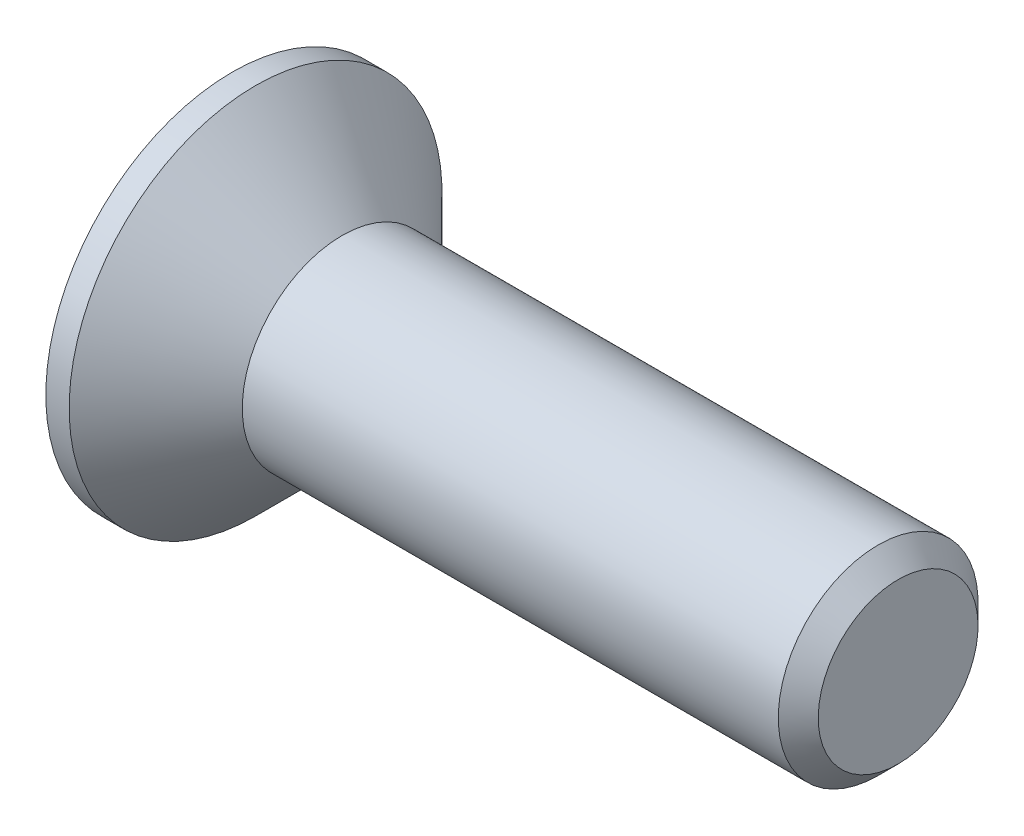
ISO-10303-21;
HEADER;
FILE_DESCRIPTION(('STEP AP214'),'2;1');
FILE_NAME('part.step','',(''),(''),'','','');
FILE_SCHEMA(('AUTOMOTIVE_DESIGN { 1 0 10303 214 1 1 1 1 }'));
ENDSEC;
DATA;
#1=APPLICATION_CONTEXT('core data for automotive mechanical design processes');
#2=APPLICATION_PROTOCOL_DEFINITION('international standard','automotive_design',2000,#1);
#3=PRODUCT_CONTEXT('',#1,'mechanical');
#4=PRODUCT('Part','Part','',(#3));
#5=PRODUCT_RELATED_PRODUCT_CATEGORY('part','',(#4));
#6=PRODUCT_DEFINITION_FORMATION('','',#4);
#7=PRODUCT_DEFINITION_CONTEXT('part definition',#1,'design');
#8=PRODUCT_DEFINITION('design','',#6,#7);
#9=PRODUCT_DEFINITION_SHAPE('','',#8);
#10=(LENGTH_UNIT() NAMED_UNIT(*) SI_UNIT(.MILLI.,.METRE.));
#11=(NAMED_UNIT(*) PLANE_ANGLE_UNIT() SI_UNIT($,.RADIAN.));
#12=(NAMED_UNIT(*) SI_UNIT($,.STERADIAN.) SOLID_ANGLE_UNIT());
#13=UNCERTAINTY_MEASURE_WITH_UNIT(LENGTH_MEASURE(1.E-05),#10,'distance_accuracy_value','');
#14=(GEOMETRIC_REPRESENTATION_CONTEXT(3) GLOBAL_UNCERTAINTY_ASSIGNED_CONTEXT((#13)) GLOBAL_UNIT_ASSIGNED_CONTEXT((#10,
#11,#12)) REPRESENTATION_CONTEXT('',''));
#15=CARTESIAN_POINT('',(0.,0.,0.));
#16=DIRECTION('',(0.,0.,1.));
#17=DIRECTION('',(1.,0.,0.));
#18=AXIS2_PLACEMENT_3D('',#15,#16,#17);
#19=CARTESIAN_POINT('',(0.,0.,0.));
#20=DIRECTION('',(-1.,0.,0.));
#21=DIRECTION('',(0.,-1.,0.));
#22=AXIS2_PLACEMENT_3D('',#19,#20,#21);
#23=CONICAL_SURFACE('',#22,1.5,0.78539816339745);
#24=CARTESIAN_POINT('',(-1.3,0.,0.));
#25=DIRECTION('',(-1.,0.,0.));
#26=DIRECTION('',(0.,-1.,0.));
#27=AXIS2_PLACEMENT_3D('',#24,#25,#26);
#28=CIRCLE('',#27,2.8);
#29=CARTESIAN_POINT('',(-1.3,-2.8,0.));
#30=VERTEX_POINT('',#29);
#31=EDGE_CURVE('E189',#30,#30,#28,.T.);
#32=ORIENTED_EDGE('',*,*,#31,.F.);
#33=EDGE_LOOP('',(#32));
#34=FACE_BOUND('',#33,.T.);
#35=CARTESIAN_POINT('',(0.,0.,0.));
#36=DIRECTION('',(-1.,0.,0.));
#37=DIRECTION('',(0.,-1.,0.));
#38=AXIS2_PLACEMENT_3D('',#35,#36,#37);
#39=CIRCLE('',#38,1.5);
#40=CARTESIAN_POINT('',(0.,-1.5,0.));
#41=VERTEX_POINT('',#40);
#42=EDGE_CURVE('E212',#41,#41,#39,.T.);
#43=ORIENTED_EDGE('',*,*,#42,.T.);
#44=EDGE_LOOP('',(#43));
#45=FACE_BOUND('',#44,.T.);
#46=ADVANCED_FACE('F33',(#34,#45),#23,.T.);
#47=CARTESIAN_POINT('',(-1.65,0.,0.));
#48=DIRECTION('',(-1.,0.,0.));
#49=DIRECTION('',(0.,-1.,0.));
#50=AXIS2_PLACEMENT_3D('',#47,#48,#49);
#51=CYLINDRICAL_SURFACE('',#50,1.5);
#52=CARTESIAN_POINT('',(8.05,0.,0.));
#53=DIRECTION('',(-1.,0.,0.));
#54=DIRECTION('',(0.,-1.,0.));
#55=AXIS2_PLACEMENT_3D('',#52,#53,#54);
#56=CIRCLE('',#55,1.5);
#57=CARTESIAN_POINT('',(8.05,-1.5,0.));
#58=VERTEX_POINT('',#57);
#59=EDGE_CURVE('E41',#58,#58,#56,.T.);
#60=ORIENTED_EDGE('',*,*,#59,.T.);
#61=EDGE_LOOP('',(#60));
#62=FACE_BOUND('',#61,.T.);
#63=ORIENTED_EDGE('',*,*,#42,.F.);
#64=EDGE_LOOP('',(#63));
#65=FACE_BOUND('',#64,.T.);
#66=ADVANCED_FACE('F217',(#62,#65),#51,.T.);
#67=CARTESIAN_POINT('',(8.35,0.,0.));
#68=DIRECTION('',(-1.,0.,0.));
#69=DIRECTION('',(0.,-1.,0.));
#70=AXIS2_PLACEMENT_3D('',#67,#68,#69);
#71=PLANE('',#70);
#72=CARTESIAN_POINT('',(8.35,0.,0.));
#73=DIRECTION('',(-1.,0.,0.));
#74=DIRECTION('',(0.,-1.,0.));
#75=AXIS2_PLACEMENT_3D('',#72,#73,#74);
#76=CIRCLE('',#75,1.19999999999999);
#77=CARTESIAN_POINT('',(8.35,-1.19999999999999,0.));
#78=VERTEX_POINT('',#77);
#79=EDGE_CURVE('E11',#78,#78,#76,.F.);
#80=ORIENTED_EDGE('',*,*,#79,.T.);
#81=EDGE_LOOP('',(#80));
#82=FACE_BOUND('',#81,.T.);
#83=ADVANCED_FACE('F239',(#82),#71,.F.);
#84=CARTESIAN_POINT('',(-1.65,2.8,0.));
#85=DIRECTION('',(1.,0.,0.));
#86=DIRECTION('',(0.,1.,0.));
#87=AXIS2_PLACEMENT_3D('',#84,#85,#86);
#88=PLANE('',#87);
#89=DIRECTION('',(0.,0.,-1.));
#90=VECTOR('',#89,1.);
#91=CARTESIAN_POINT('',(-1.65,0.365,-1.45));
#92=LINE('',#91,#90);
#93=CARTESIAN_POINT('',(-1.65,0.365,-0.365));
#94=VERTEX_POINT('',#93);
#95=CARTESIAN_POINT('',(-1.65,0.365,-1.45));
#96=VERTEX_POINT('',#95);
#97=EDGE_CURVE('E158',#94,#96,#92,.T.);
#98=ORIENTED_EDGE('',*,*,#97,.F.);
#99=DIRECTION('',(0.,-1.,0.));
#100=VECTOR('',#99,1.);
#101=CARTESIAN_POINT('',(-1.65,0.365,-0.365));
#102=LINE('',#101,#100);
#103=CARTESIAN_POINT('',(-1.65,1.45,-0.365));
#104=VERTEX_POINT('',#103);
#105=EDGE_CURVE('E48',#104,#94,#102,.T.);
#106=ORIENTED_EDGE('',*,*,#105,.F.);
#107=DIRECTION('',(0.,0.,-1.));
#108=VECTOR('',#107,1.);
#109=CARTESIAN_POINT('',(-1.65,1.45,-0.365));
#110=LINE('',#109,#108);
#111=CARTESIAN_POINT('',(-1.65,1.45,0.365));
#112=VERTEX_POINT('',#111);
#113=EDGE_CURVE('E185',#112,#104,#110,.T.);
#114=ORIENTED_EDGE('',*,*,#113,.F.);
#115=DIRECTION('',(0.,1.,0.));
#116=VECTOR('',#115,1.);
#117=CARTESIAN_POINT('',(-1.65,1.45,0.365));
#118=LINE('',#117,#116);
#119=CARTESIAN_POINT('',(-1.65,0.365,0.365));
#120=VERTEX_POINT('',#119);
#121=EDGE_CURVE('E183',#120,#112,#118,.T.);
#122=ORIENTED_EDGE('',*,*,#121,.F.);
#123=DIRECTION('',(0.,0.,-1.));
#124=VECTOR('',#123,1.);
#125=CARTESIAN_POINT('',(-1.65,0.365,0.365));
#126=LINE('',#125,#124);
#127=CARTESIAN_POINT('',(-1.65,0.365,1.45));
#128=VERTEX_POINT('',#127);
#129=EDGE_CURVE('E132',#128,#120,#126,.T.);
#130=ORIENTED_EDGE('',*,*,#129,.F.);
#131=DIRECTION('',(0.,1.,0.));
#132=VECTOR('',#131,1.);
#133=CARTESIAN_POINT('',(-1.65,0.365,1.45));
#134=LINE('',#133,#132);
#135=CARTESIAN_POINT('',(-1.65,-0.365,1.45));
#136=VERTEX_POINT('',#135);
#137=EDGE_CURVE('E179',#136,#128,#134,.T.);
#138=ORIENTED_EDGE('',*,*,#137,.F.);
#139=DIRECTION('',(0.,0.,1.));
#140=VECTOR('',#139,1.);
#141=CARTESIAN_POINT('',(-1.65,-0.365,1.45));
#142=LINE('',#141,#140);
#143=CARTESIAN_POINT('',(-1.65,-0.365,0.365));
#144=VERTEX_POINT('',#143);
#145=EDGE_CURVE('E176',#144,#136,#142,.T.);
#146=ORIENTED_EDGE('',*,*,#145,.F.);
#147=DIRECTION('',(0.,1.,0.));
#148=VECTOR('',#147,1.);
#149=CARTESIAN_POINT('',(-1.65,-0.365,0.365));
#150=LINE('',#149,#148);
#151=CARTESIAN_POINT('',(-1.65,-1.45,0.365));
#152=VERTEX_POINT('',#151);
#153=EDGE_CURVE('E173',#152,#144,#150,.T.);
#154=ORIENTED_EDGE('',*,*,#153,.F.);
#155=DIRECTION('',(0.,0.,1.));
#156=VECTOR('',#155,1.);
#157=CARTESIAN_POINT('',(-1.65,-1.45,0.365));
#158=LINE('',#157,#156);
#159=CARTESIAN_POINT('',(-1.65,-1.45,-0.365));
#160=VERTEX_POINT('',#159);
#161=EDGE_CURVE('E170',#160,#152,#158,.T.);
#162=ORIENTED_EDGE('',*,*,#161,.F.);
#163=DIRECTION('',(0.,-1.,0.));
#164=VECTOR('',#163,1.);
#165=CARTESIAN_POINT('',(-1.65,-1.45,-0.365));
#166=LINE('',#165,#164);
#167=CARTESIAN_POINT('',(-1.65,-0.365,-0.365));
#168=VERTEX_POINT('',#167);
#169=EDGE_CURVE('E167',#168,#160,#166,.T.);
#170=ORIENTED_EDGE('',*,*,#169,.F.);
#171=DIRECTION('',(0.,0.,1.));
#172=VECTOR('',#171,1.);
#173=CARTESIAN_POINT('',(-1.65,-0.365,-0.365));
#174=LINE('',#173,#172);
#175=CARTESIAN_POINT('',(-1.65,-0.365,-1.45));
#176=VERTEX_POINT('',#175);
#177=EDGE_CURVE('E164',#176,#168,#174,.T.);
#178=ORIENTED_EDGE('',*,*,#177,.F.);
#179=DIRECTION('',(0.,-1.,0.));
#180=VECTOR('',#179,1.);
#181=CARTESIAN_POINT('',(-1.65,-0.365,-1.45));
#182=LINE('',#181,#180);
#183=EDGE_CURVE('E161',#96,#176,#182,.T.);
#184=ORIENTED_EDGE('',*,*,#183,.F.);
#185=EDGE_LOOP('',(#98,#106,#114,#122,#130,#138,#146,#154,#162,#170,#178,#184));
#186=FACE_BOUND('',#185,.T.);
#187=CARTESIAN_POINT('',(-1.65,0.,0.));
#188=DIRECTION('',(-1.,0.,0.));
#189=DIRECTION('',(0.,-1.,0.));
#190=AXIS2_PLACEMENT_3D('',#187,#188,#189);
#191=CIRCLE('',#190,2.8);
#192=CARTESIAN_POINT('',(-1.65,-2.8,0.));
#193=VERTEX_POINT('',#192);
#194=EDGE_CURVE('E209',#193,#193,#191,.T.);
#195=ORIENTED_EDGE('',*,*,#194,.T.);
#196=EDGE_LOOP('',(#195));
#197=FACE_BOUND('',#196,.T.);
#198=ADVANCED_FACE('F230',(#186,#197),#88,.F.);
#199=CARTESIAN_POINT('',(-1.65,0.,0.));
#200=DIRECTION('',(-1.,0.,0.));
#201=DIRECTION('',(0.,-1.,0.));
#202=AXIS2_PLACEMENT_3D('',#199,#200,#201);
#203=CYLINDRICAL_SURFACE('',#202,2.8);
#204=ORIENTED_EDGE('',*,*,#194,.F.);
#205=EDGE_LOOP('',(#204));
#206=FACE_BOUND('',#205,.T.);
#207=ORIENTED_EDGE('',*,*,#31,.T.);
#208=EDGE_LOOP('',(#207));
#209=FACE_BOUND('',#208,.T.);
#210=ADVANCED_FACE('F222',(#206,#209),#203,.T.);
#211=CARTESIAN_POINT('',(8.05,0.,0.));
#212=DIRECTION('',(-1.,0.,0.));
#213=DIRECTION('',(0.,-1.,0.));
#214=AXIS2_PLACEMENT_3D('',#211,#212,#213);
#215=CONICAL_SURFACE('',#214,1.5,0.785398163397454);
#216=ORIENTED_EDGE('',*,*,#79,.F.);
#217=EDGE_LOOP('',(#216));
#218=FACE_BOUND('',#217,.T.);
#219=ORIENTED_EDGE('',*,*,#59,.F.);
#220=EDGE_LOOP('',(#219));
#221=FACE_BOUND('',#220,.T.);
#222=ADVANCED_FACE('F35',(#218,#221),#215,.T.);
#223=CARTESIAN_POINT('',(-0.4,0.365,-0.365));
#224=DIRECTION('',(0.,0.,-1.));
#225=DIRECTION('',(-1.,0.,0.));
#226=AXIS2_PLACEMENT_3D('',#223,#224,#225);
#227=PLANE('',#226);
#228=ORIENTED_EDGE('',*,*,#105,.T.);
#229=DIRECTION('',(-1.,0.,0.));
#230=VECTOR('',#229,1.);
#231=CARTESIAN_POINT('',(-0.4,0.365,-0.365));
#232=LINE('',#231,#230);
#233=CARTESIAN_POINT('',(-0.4,0.365,-0.365));
#234=VERTEX_POINT('',#233);
#235=EDGE_CURVE('E96',#234,#94,#232,.T.);
#236=ORIENTED_EDGE('',*,*,#235,.F.);
#237=DIRECTION('',(0.,-1.,0.));
#238=VECTOR('',#237,1.);
#239=CARTESIAN_POINT('',(-0.4,0.365,-0.365));
#240=LINE('',#239,#238);
#241=CARTESIAN_POINT('',(-0.4,1.45,-0.365));
#242=VERTEX_POINT('',#241);
#243=EDGE_CURVE('E187',#242,#234,#240,.T.);
#244=ORIENTED_EDGE('',*,*,#243,.F.);
#245=DIRECTION('',(-1.,0.,0.));
#246=VECTOR('',#245,1.);
#247=CARTESIAN_POINT('',(-0.4,1.45,-0.365));
#248=LINE('',#247,#246);
#249=EDGE_CURVE('E56',#242,#104,#248,.T.);
#250=ORIENTED_EDGE('',*,*,#249,.T.);
#251=EDGE_LOOP('',(#228,#236,#244,#250));
#252=FACE_BOUND('',#251,.T.);
#253=ADVANCED_FACE('F221',(#252),#227,.F.);
#254=CARTESIAN_POINT('',(-0.4,1.45,-0.365));
#255=DIRECTION('',(0.,1.,0.));
#256=DIRECTION('',(-1.,0.,0.));
#257=AXIS2_PLACEMENT_3D('',#254,#255,#256);
#258=PLANE('',#257);
#259=ORIENTED_EDGE('',*,*,#113,.T.);
#260=ORIENTED_EDGE('',*,*,#249,.F.);
#261=DIRECTION('',(0.,0.,-1.));
#262=VECTOR('',#261,1.);
#263=CARTESIAN_POINT('',(-0.4,1.45,-0.365));
#264=LINE('',#263,#262);
#265=CARTESIAN_POINT('',(-0.4,1.45,0.365));
#266=VERTEX_POINT('',#265);
#267=EDGE_CURVE('E144',#266,#242,#264,.T.);
#268=ORIENTED_EDGE('',*,*,#267,.F.);
#269=DIRECTION('',(-1.,0.,0.));
#270=VECTOR('',#269,1.);
#271=CARTESIAN_POINT('',(-0.4,1.45,0.365));
#272=LINE('',#271,#270);
#273=EDGE_CURVE('E136',#266,#112,#272,.T.);
#274=ORIENTED_EDGE('',*,*,#273,.T.);
#275=EDGE_LOOP('',(#259,#260,#268,#274));
#276=FACE_BOUND('',#275,.T.);
#277=ADVANCED_FACE('F228',(#276),#258,.F.);
#278=CARTESIAN_POINT('',(-0.4,1.45,0.365));
#279=DIRECTION('',(0.,0.,1.));
#280=DIRECTION('',(1.,0.,0.));
#281=AXIS2_PLACEMENT_3D('',#278,#279,#280);
#282=PLANE('',#281);
#283=ORIENTED_EDGE('',*,*,#121,.T.);
#284=ORIENTED_EDGE('',*,*,#273,.F.);
#285=DIRECTION('',(0.,1.,0.));
#286=VECTOR('',#285,1.);
#287=CARTESIAN_POINT('',(-0.4,1.45,0.365));
#288=LINE('',#287,#286);
#289=CARTESIAN_POINT('',(-0.4,0.365,0.365));
#290=VERTEX_POINT('',#289);
#291=EDGE_CURVE('E140',#290,#266,#288,.T.);
#292=ORIENTED_EDGE('',*,*,#291,.F.);
#293=DIRECTION('',(-1.,0.,0.));
#294=VECTOR('',#293,1.);
#295=CARTESIAN_POINT('',(-0.4,0.365,0.365));
#296=LINE('',#295,#294);
#297=EDGE_CURVE('E125',#290,#120,#296,.T.);
#298=ORIENTED_EDGE('',*,*,#297,.T.);
#299=EDGE_LOOP('',(#283,#284,#292,#298));
#300=FACE_BOUND('',#299,.T.);
#301=ADVANCED_FACE('F141',(#300),#282,.F.);
#302=CARTESIAN_POINT('',(-0.4,0.365,0.365));
#303=DIRECTION('',(0.,1.,0.));
#304=DIRECTION('',(-1.,0.,0.));
#305=AXIS2_PLACEMENT_3D('',#302,#303,#304);
#306=PLANE('',#305);
#307=ORIENTED_EDGE('',*,*,#129,.T.);
#308=ORIENTED_EDGE('',*,*,#297,.F.);
#309=DIRECTION('',(0.,0.,-1.));
#310=VECTOR('',#309,1.);
#311=CARTESIAN_POINT('',(-0.4,0.365,0.365));
#312=LINE('',#311,#310);
#313=CARTESIAN_POINT('',(-0.4,0.365,1.45));
#314=VERTEX_POINT('',#313);
#315=EDGE_CURVE('E129',#314,#290,#312,.T.);
#316=ORIENTED_EDGE('',*,*,#315,.F.);
#317=DIRECTION('',(-1.,0.,0.));
#318=VECTOR('',#317,1.);
#319=CARTESIAN_POINT('',(-0.4,0.365,1.45));
#320=LINE('',#319,#318);
#321=EDGE_CURVE('E137',#314,#128,#320,.T.);
#322=ORIENTED_EDGE('',*,*,#321,.T.);
#323=EDGE_LOOP('',(#307,#308,#316,#322));
#324=FACE_BOUND('',#323,.T.);
#325=ADVANCED_FACE('F127',(#324),#306,.F.);
#326=CARTESIAN_POINT('',(-0.4,0.365,1.45));
#327=DIRECTION('',(0.,0.,1.));
#328=DIRECTION('',(1.,0.,0.));
#329=AXIS2_PLACEMENT_3D('',#326,#327,#328);
#330=PLANE('',#329);
#331=ORIENTED_EDGE('',*,*,#137,.T.);
#332=ORIENTED_EDGE('',*,*,#321,.F.);
#333=DIRECTION('',(0.,1.,0.));
#334=VECTOR('',#333,1.);
#335=CARTESIAN_POINT('',(-0.4,0.365,1.45));
#336=LINE('',#335,#334);
#337=CARTESIAN_POINT('',(-0.4,-0.365,1.45));
#338=VERTEX_POINT('',#337);
#339=EDGE_CURVE('E150',#338,#314,#336,.T.);
#340=ORIENTED_EDGE('',*,*,#339,.F.);
#341=DIRECTION('',(-1.,0.,0.));
#342=VECTOR('',#341,1.);
#343=CARTESIAN_POINT('',(-0.4,-0.365,1.45));
#344=LINE('',#343,#342);
#345=EDGE_CURVE('E192',#338,#136,#344,.T.);
#346=ORIENTED_EDGE('',*,*,#345,.T.);
#347=EDGE_LOOP('',(#331,#332,#340,#346));
#348=FACE_BOUND('',#347,.T.);
#349=ADVANCED_FACE('F277',(#348),#330,.F.);
#350=CARTESIAN_POINT('',(-0.4,-0.365,1.45));
#351=DIRECTION('',(0.,-1.,0.));
#352=DIRECTION('',(1.,0.,0.));
#353=AXIS2_PLACEMENT_3D('',#350,#351,#352);
#354=PLANE('',#353);
#355=ORIENTED_EDGE('',*,*,#145,.T.);
#356=ORIENTED_EDGE('',*,*,#345,.F.);
#357=DIRECTION('',(0.,0.,1.));
#358=VECTOR('',#357,1.);
#359=CARTESIAN_POINT('',(-0.4,-0.365,1.45));
#360=LINE('',#359,#358);
#361=CARTESIAN_POINT('',(-0.4,-0.365,0.365));
#362=VERTEX_POINT('',#361);
#363=EDGE_CURVE('E152',#362,#338,#360,.T.);
#364=ORIENTED_EDGE('',*,*,#363,.F.);
#365=DIRECTION('',(-1.,0.,0.));
#366=VECTOR('',#365,1.);
#367=CARTESIAN_POINT('',(-0.4,-0.365,0.365));
#368=LINE('',#367,#366);
#369=EDGE_CURVE('E194',#362,#144,#368,.T.);
#370=ORIENTED_EDGE('',*,*,#369,.T.);
#371=EDGE_LOOP('',(#355,#356,#364,#370));
#372=FACE_BOUND('',#371,.T.);
#373=ADVANCED_FACE('F273',(#372),#354,.F.);
#374=CARTESIAN_POINT('',(-0.4,-0.365,0.365));
#375=DIRECTION('',(0.,0.,1.));
#376=DIRECTION('',(1.,0.,0.));
#377=AXIS2_PLACEMENT_3D('',#374,#375,#376);
#378=PLANE('',#377);
#379=ORIENTED_EDGE('',*,*,#153,.T.);
#380=ORIENTED_EDGE('',*,*,#369,.F.);
#381=DIRECTION('',(0.,1.,0.));
#382=VECTOR('',#381,1.);
#383=CARTESIAN_POINT('',(-0.4,-0.365,0.365));
#384=LINE('',#383,#382);
#385=CARTESIAN_POINT('',(-0.4,-1.45,0.365));
#386=VERTEX_POINT('',#385);
#387=EDGE_CURVE('E422',#386,#362,#384,.T.);
#388=ORIENTED_EDGE('',*,*,#387,.F.);
#389=DIRECTION('',(-1.,0.,0.));
#390=VECTOR('',#389,1.);
#391=CARTESIAN_POINT('',(-0.4,-1.45,0.365));
#392=LINE('',#391,#390);
#393=EDGE_CURVE('E196',#386,#152,#392,.T.);
#394=ORIENTED_EDGE('',*,*,#393,.T.);
#395=EDGE_LOOP('',(#379,#380,#388,#394));
#396=FACE_BOUND('',#395,.T.);
#397=ADVANCED_FACE('F269',(#396),#378,.F.);
#398=CARTESIAN_POINT('',(-0.4,-1.45,0.365));
#399=DIRECTION('',(0.,-1.,0.));
#400=DIRECTION('',(1.,0.,0.));
#401=AXIS2_PLACEMENT_3D('',#398,#399,#400);
#402=PLANE('',#401);
#403=ORIENTED_EDGE('',*,*,#161,.T.);
#404=ORIENTED_EDGE('',*,*,#393,.F.);
#405=DIRECTION('',(0.,0.,1.));
#406=VECTOR('',#405,1.);
#407=CARTESIAN_POINT('',(-0.4,-1.45,0.365));
#408=LINE('',#407,#406);
#409=CARTESIAN_POINT('',(-0.4,-1.45,-0.365));
#410=VERTEX_POINT('',#409);
#411=EDGE_CURVE('E419',#410,#386,#408,.T.);
#412=ORIENTED_EDGE('',*,*,#411,.F.);
#413=DIRECTION('',(-1.,0.,0.));
#414=VECTOR('',#413,1.);
#415=CARTESIAN_POINT('',(-0.4,-1.45,-0.365));
#416=LINE('',#415,#414);
#417=EDGE_CURVE('E198',#410,#160,#416,.T.);
#418=ORIENTED_EDGE('',*,*,#417,.T.);
#419=EDGE_LOOP('',(#403,#404,#412,#418));
#420=FACE_BOUND('',#419,.T.);
#421=ADVANCED_FACE('F265',(#420),#402,.F.);
#422=CARTESIAN_POINT('',(-0.4,-1.45,-0.365));
#423=DIRECTION('',(0.,0.,-1.));
#424=DIRECTION('',(-1.,0.,0.));
#425=AXIS2_PLACEMENT_3D('',#422,#423,#424);
#426=PLANE('',#425);
#427=ORIENTED_EDGE('',*,*,#169,.T.);
#428=ORIENTED_EDGE('',*,*,#417,.F.);
#429=DIRECTION('',(0.,-1.,0.));
#430=VECTOR('',#429,1.);
#431=CARTESIAN_POINT('',(-0.4,-1.45,-0.365));
#432=LINE('',#431,#430);
#433=CARTESIAN_POINT('',(-0.4,-0.365,-0.365));
#434=VERTEX_POINT('',#433);
#435=EDGE_CURVE('E416',#434,#410,#432,.T.);
#436=ORIENTED_EDGE('',*,*,#435,.F.);
#437=DIRECTION('',(-1.,0.,0.));
#438=VECTOR('',#437,1.);
#439=CARTESIAN_POINT('',(-0.4,-0.365,-0.365));
#440=LINE('',#439,#438);
#441=EDGE_CURVE('E200',#434,#168,#440,.T.);
#442=ORIENTED_EDGE('',*,*,#441,.T.);
#443=EDGE_LOOP('',(#427,#428,#436,#442));
#444=FACE_BOUND('',#443,.T.);
#445=ADVANCED_FACE('F261',(#444),#426,.F.);
#446=CARTESIAN_POINT('',(-0.4,-0.365,-0.365));
#447=DIRECTION('',(0.,-1.,0.));
#448=DIRECTION('',(1.,0.,0.));
#449=AXIS2_PLACEMENT_3D('',#446,#447,#448);
#450=PLANE('',#449);
#451=ORIENTED_EDGE('',*,*,#177,.T.);
#452=ORIENTED_EDGE('',*,*,#441,.F.);
#453=DIRECTION('',(0.,0.,1.));
#454=VECTOR('',#453,1.);
#455=CARTESIAN_POINT('',(-0.4,-0.365,-0.365));
#456=LINE('',#455,#454);
#457=CARTESIAN_POINT('',(-0.4,-0.365,-1.45));
#458=VERTEX_POINT('',#457);
#459=EDGE_CURVE('E413',#458,#434,#456,.T.);
#460=ORIENTED_EDGE('',*,*,#459,.F.);
#461=DIRECTION('',(-1.,0.,0.));
#462=VECTOR('',#461,1.);
#463=CARTESIAN_POINT('',(-0.4,-0.365,-1.45));
#464=LINE('',#463,#462);
#465=EDGE_CURVE('E202',#458,#176,#464,.T.);
#466=ORIENTED_EDGE('',*,*,#465,.T.);
#467=EDGE_LOOP('',(#451,#452,#460,#466));
#468=FACE_BOUND('',#467,.T.);
#469=ADVANCED_FACE('F257',(#468),#450,.F.);
#470=CARTESIAN_POINT('',(-0.4,-0.365,-1.45));
#471=DIRECTION('',(0.,0.,-1.));
#472=DIRECTION('',(-1.,0.,0.));
#473=AXIS2_PLACEMENT_3D('',#470,#471,#472);
#474=PLANE('',#473);
#475=ORIENTED_EDGE('',*,*,#183,.T.);
#476=ORIENTED_EDGE('',*,*,#465,.F.);
#477=DIRECTION('',(0.,-1.,0.));
#478=VECTOR('',#477,1.);
#479=CARTESIAN_POINT('',(-0.4,-0.365,-1.45));
#480=LINE('',#479,#478);
#481=CARTESIAN_POINT('',(-0.4,0.365,-1.45));
#482=VERTEX_POINT('',#481);
#483=EDGE_CURVE('E408',#482,#458,#480,.T.);
#484=ORIENTED_EDGE('',*,*,#483,.F.);
#485=DIRECTION('',(-1.,0.,0.));
#486=VECTOR('',#485,1.);
#487=CARTESIAN_POINT('',(-0.4,0.365,-1.45));
#488=LINE('',#487,#486);
#489=EDGE_CURVE('E204',#482,#96,#488,.T.);
#490=ORIENTED_EDGE('',*,*,#489,.T.);
#491=EDGE_LOOP('',(#475,#476,#484,#490));
#492=FACE_BOUND('',#491,.T.);
#493=ADVANCED_FACE('F253',(#492),#474,.F.);
#494=CARTESIAN_POINT('',(-0.4,0.365,-1.45));
#495=DIRECTION('',(0.,1.,0.));
#496=DIRECTION('',(-1.,0.,0.));
#497=AXIS2_PLACEMENT_3D('',#494,#495,#496);
#498=PLANE('',#497);
#499=ORIENTED_EDGE('',*,*,#97,.T.);
#500=ORIENTED_EDGE('',*,*,#489,.F.);
#501=DIRECTION('',(0.,0.,-1.));
#502=VECTOR('',#501,1.);
#503=CARTESIAN_POINT('',(-0.4,0.365,-1.45));
#504=LINE('',#503,#502);
#505=EDGE_CURVE('E406',#234,#482,#504,.T.);
#506=ORIENTED_EDGE('',*,*,#505,.F.);
#507=ORIENTED_EDGE('',*,*,#235,.T.);
#508=EDGE_LOOP('',(#499,#500,#506,#507));
#509=FACE_BOUND('',#508,.T.);
#510=ADVANCED_FACE('F250',(#509),#498,.F.);
#511=CARTESIAN_POINT('',(-0.4,0.,0.));
#512=DIRECTION('',(1.,0.,0.));
#513=DIRECTION('',(0.,0.,-1.));
#514=AXIS2_PLACEMENT_3D('',#511,#512,#513);
#515=PLANE('',#514);
#516=ORIENTED_EDGE('',*,*,#243,.T.);
#517=ORIENTED_EDGE('',*,*,#505,.T.);
#518=ORIENTED_EDGE('',*,*,#483,.T.);
#519=ORIENTED_EDGE('',*,*,#459,.T.);
#520=ORIENTED_EDGE('',*,*,#435,.T.);
#521=ORIENTED_EDGE('',*,*,#411,.T.);
#522=ORIENTED_EDGE('',*,*,#387,.T.);
#523=ORIENTED_EDGE('',*,*,#363,.T.);
#524=ORIENTED_EDGE('',*,*,#339,.T.);
#525=ORIENTED_EDGE('',*,*,#315,.T.);
#526=ORIENTED_EDGE('',*,*,#291,.T.);
#527=ORIENTED_EDGE('',*,*,#267,.T.);
#528=EDGE_LOOP('',(#516,#517,#518,#519,#520,#521,#522,#523,#524,#525,#526,#527));
#529=FACE_BOUND('',#528,.T.);
#530=ADVANCED_FACE('F147',(#529),#515,.F.);
#531=CLOSED_SHELL('',(#46,#66,#83,#198,#210,#222,#253,#277,#301,#325,#349,#373,#397,#421,#445,
#469,#493,#510,#530));
#532=MANIFOLD_SOLID_BREP('B2',#531);
#533=ADVANCED_BREP_SHAPE_REPRESENTATION('',(#18,#532),#14);
#534=SHAPE_DEFINITION_REPRESENTATION(#9,#533);
ENDSEC;
END-ISO-10303-21;
